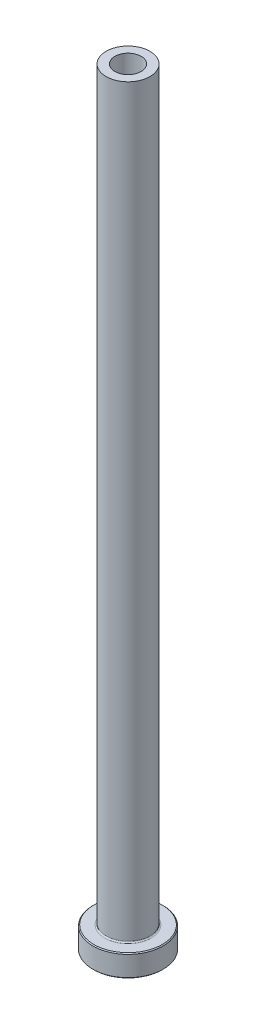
ISO-10303-21;
HEADER;
FILE_DESCRIPTION(('STEP AP214'),'2;1');
FILE_NAME('part.step','',(''),(''),'','','');
FILE_SCHEMA(('AUTOMOTIVE_DESIGN { 1 0 10303 214 1 1 1 1 }'));
ENDSEC;
DATA;
#1=APPLICATION_CONTEXT('core data for automotive mechanical design processes');
#2=APPLICATION_PROTOCOL_DEFINITION('international standard','automotive_design',2000,#1);
#3=PRODUCT_CONTEXT('',#1,'mechanical');
#4=PRODUCT('Part','Part','',(#3));
#5=PRODUCT_RELATED_PRODUCT_CATEGORY('part','',(#4));
#6=PRODUCT_DEFINITION_FORMATION('','',#4);
#7=PRODUCT_DEFINITION_CONTEXT('part definition',#1,'design');
#8=PRODUCT_DEFINITION('design','',#6,#7);
#9=PRODUCT_DEFINITION_SHAPE('','',#8);
#10=(LENGTH_UNIT() NAMED_UNIT(*) SI_UNIT(.MILLI.,.METRE.));
#11=(NAMED_UNIT(*) PLANE_ANGLE_UNIT() SI_UNIT($,.RADIAN.));
#12=(NAMED_UNIT(*) SI_UNIT($,.STERADIAN.) SOLID_ANGLE_UNIT());
#13=UNCERTAINTY_MEASURE_WITH_UNIT(LENGTH_MEASURE(1.E-05),#10,'distance_accuracy_value','');
#14=(GEOMETRIC_REPRESENTATION_CONTEXT(3) GLOBAL_UNCERTAINTY_ASSIGNED_CONTEXT((#13)) GLOBAL_UNIT_ASSIGNED_CONTEXT((#10,
#11,#12)) REPRESENTATION_CONTEXT('',''));
#15=CARTESIAN_POINT('',(0.,0.,0.));
#16=DIRECTION('',(0.,0.,1.));
#17=DIRECTION('',(1.,0.,0.));
#18=AXIS2_PLACEMENT_3D('',#15,#16,#17);
#19=CARTESIAN_POINT('',(0.,92.1876809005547,0.));
#20=DIRECTION('',(0.,1.,0.));
#21=DIRECTION('',(0.,0.,1.));
#22=AXIS2_PLACEMENT_3D('',#19,#20,#21);
#23=CYLINDRICAL_SURFACE('',#22,3.);
#24=CARTESIAN_POINT('',(0.,175.,0.));
#25=DIRECTION('',(0.,1.,0.));
#26=DIRECTION('',(0.,0.,1.));
#27=AXIS2_PLACEMENT_3D('',#24,#25,#26);
#28=CIRCLE('',#27,3.);
#29=CARTESIAN_POINT('',(0.,175.,3.));
#30=VERTEX_POINT('',#29);
#31=EDGE_CURVE('E62',#30,#30,#28,.T.);
#32=ORIENTED_EDGE('',*,*,#31,.T.);
#33=EDGE_LOOP('',(#32));
#34=FACE_BOUND('',#33,.T.);
#35=CARTESIAN_POINT('',(0.,130.,0.));
#36=DIRECTION('',(0.,1.,0.));
#37=DIRECTION('',(0.,0.,1.));
#38=AXIS2_PLACEMENT_3D('',#35,#36,#37);
#39=CIRCLE('',#38,3.);
#40=CARTESIAN_POINT('',(0.,130.,3.));
#41=VERTEX_POINT('',#40);
#42=EDGE_CURVE('E71',#41,#41,#39,.T.);
#43=ORIENTED_EDGE('',*,*,#42,.F.);
#44=EDGE_LOOP('',(#43));
#45=FACE_BOUND('',#44,.T.);
#46=ADVANCED_FACE('F30',(#34,#45),#23,.F.);
#47=CARTESIAN_POINT('',(-3.,175.,0.));
#48=DIRECTION('',(0.,1.,0.));
#49=DIRECTION('',(0.,0.,1.));
#50=AXIS2_PLACEMENT_3D('',#47,#48,#49);
#51=PLANE('',#50);
#52=CARTESIAN_POINT('',(0.,175.,0.));
#53=DIRECTION('',(0.,1.,0.));
#54=DIRECTION('',(0.,0.,1.));
#55=AXIS2_PLACEMENT_3D('',#52,#53,#54);
#56=CIRCLE('',#55,5.00000000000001);
#57=CARTESIAN_POINT('',(0.,175.,5.00000000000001));
#58=VERTEX_POINT('',#57);
#59=EDGE_CURVE('E65',#58,#58,#56,.T.);
#60=ORIENTED_EDGE('',*,*,#59,.T.);
#61=EDGE_LOOP('',(#60));
#62=FACE_BOUND('',#61,.T.);
#63=ORIENTED_EDGE('',*,*,#31,.F.);
#64=EDGE_LOOP('',(#63));
#65=FACE_BOUND('',#64,.T.);
#66=ADVANCED_FACE('F79',(#62,#65),#51,.T.);
#67=CARTESIAN_POINT('',(0.,92.1876809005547,0.));
#68=DIRECTION('',(0.,1.,0.));
#69=DIRECTION('',(0.,0.,1.));
#70=AXIS2_PLACEMENT_3D('',#67,#68,#69);
#71=CYLINDRICAL_SURFACE('',#70,5.);
#72=CARTESIAN_POINT('',(0.,5.3,0.));
#73=DIRECTION('',(0.,1.,0.));
#74=DIRECTION('',(0.,0.,1.));
#75=AXIS2_PLACEMENT_3D('',#72,#73,#74);
#76=CIRCLE('',#75,5.);
#77=CARTESIAN_POINT('',(0.,5.3,5.));
#78=VERTEX_POINT('',#77);
#79=EDGE_CURVE('E59',#78,#78,#76,.T.);
#80=ORIENTED_EDGE('',*,*,#79,.T.);
#81=EDGE_LOOP('',(#80));
#82=FACE_BOUND('',#81,.T.);
#83=ORIENTED_EDGE('',*,*,#59,.F.);
#84=EDGE_LOOP('',(#83));
#85=FACE_BOUND('',#84,.T.);
#86=ADVANCED_FACE('F85',(#82,#85),#71,.T.);
#87=CARTESIAN_POINT('',(-4.99999999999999,5.,0.));
#88=DIRECTION('',(0.,1.,0.));
#89=DIRECTION('',(0.,0.,1.));
#90=AXIS2_PLACEMENT_3D('',#87,#88,#89);
#91=PLANE('',#90);
#92=CARTESIAN_POINT('',(0.,5.,0.));
#93=DIRECTION('',(0.,1.,0.));
#94=DIRECTION('',(0.,0.,1.));
#95=AXIS2_PLACEMENT_3D('',#92,#93,#94);
#96=CIRCLE('',#95,7.80000000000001);
#97=CARTESIAN_POINT('',(0.,5.,-7.80000000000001));
#98=VERTEX_POINT('',#97);
#99=EDGE_CURVE('E53',#98,#98,#96,.T.);
#100=ORIENTED_EDGE('',*,*,#99,.T.);
#101=EDGE_LOOP('',(#100));
#102=FACE_BOUND('',#101,.T.);
#103=CARTESIAN_POINT('',(0.,5.,0.));
#104=DIRECTION('',(0.,1.,0.));
#105=DIRECTION('',(0.,0.,1.));
#106=AXIS2_PLACEMENT_3D('',#103,#104,#105);
#107=CIRCLE('',#106,5.3);
#108=CARTESIAN_POINT('',(0.,5.,5.3));
#109=VERTEX_POINT('',#108);
#110=EDGE_CURVE('E56',#109,#109,#107,.F.);
#111=ORIENTED_EDGE('',*,*,#110,.T.);
#112=EDGE_LOOP('',(#111));
#113=FACE_BOUND('',#112,.T.);
#114=ADVANCED_FACE('F111',(#102,#113),#91,.T.);
#115=CARTESIAN_POINT('',(0.,92.1876809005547,0.));
#116=DIRECTION('',(0.,1.,0.));
#117=DIRECTION('',(0.,0.,1.));
#118=AXIS2_PLACEMENT_3D('',#115,#116,#117);
#119=CYLINDRICAL_SURFACE('',#118,7.99999999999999);
#120=CARTESIAN_POINT('',(0.,4.80000000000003,0.));
#121=DIRECTION('',(0.,1.,0.));
#122=DIRECTION('',(0.,0.,1.));
#123=AXIS2_PLACEMENT_3D('',#120,#121,#122);
#124=CIRCLE('',#123,7.99999999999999);
#125=CARTESIAN_POINT('',(0.,4.80000000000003,-7.99999999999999));
#126=VERTEX_POINT('',#125);
#127=EDGE_CURVE('E45',#126,#126,#124,.F.);
#128=ORIENTED_EDGE('',*,*,#127,.T.);
#129=EDGE_LOOP('',(#128));
#130=FACE_BOUND('',#129,.T.);
#131=CARTESIAN_POINT('',(0.,0.200000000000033,0.));
#132=DIRECTION('',(0.,-1.,0.));
#133=DIRECTION('',(0.,0.,-1.));
#134=AXIS2_PLACEMENT_3D('',#131,#132,#133);
#135=CIRCLE('',#134,7.99999999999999);
#136=CARTESIAN_POINT('',(0.,0.200000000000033,-7.99999999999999));
#137=VERTEX_POINT('',#136);
#138=EDGE_CURVE('E50',#137,#137,#135,.F.);
#139=ORIENTED_EDGE('',*,*,#138,.T.);
#140=EDGE_LOOP('',(#139));
#141=FACE_BOUND('',#140,.T.);
#142=ADVANCED_FACE('F108',(#130,#141),#119,.T.);
#143=CARTESIAN_POINT('',(-7.99999999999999,0.,0.));
#144=DIRECTION('',(0.,-1.,0.));
#145=DIRECTION('',(0.,0.,-1.));
#146=AXIS2_PLACEMENT_3D('',#143,#144,#145);
#147=PLANE('',#146);
#148=CARTESIAN_POINT('',(0.,0.,0.));
#149=DIRECTION('',(0.,-1.,0.));
#150=DIRECTION('',(0.,0.,-1.));
#151=AXIS2_PLACEMENT_3D('',#148,#149,#150);
#152=CIRCLE('',#151,3.74999999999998);
#153=CARTESIAN_POINT('',(0.,0.,-3.74999999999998));
#154=VERTEX_POINT('',#153);
#155=EDGE_CURVE('E37',#154,#154,#152,.F.);
#156=ORIENTED_EDGE('',*,*,#155,.T.);
#157=EDGE_LOOP('',(#156));
#158=FACE_BOUND('',#157,.T.);
#159=CARTESIAN_POINT('',(0.,0.,0.));
#160=DIRECTION('',(0.,-1.,0.));
#161=DIRECTION('',(0.,0.,-1.));
#162=AXIS2_PLACEMENT_3D('',#159,#160,#161);
#163=CIRCLE('',#162,7.79999999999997);
#164=CARTESIAN_POINT('',(0.,0.,-7.79999999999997));
#165=VERTEX_POINT('',#164);
#166=EDGE_CURVE('E41',#165,#165,#163,.T.);
#167=ORIENTED_EDGE('',*,*,#166,.T.);
#168=EDGE_LOOP('',(#167));
#169=FACE_BOUND('',#168,.T.);
#170=ADVANCED_FACE('F110',(#158,#169),#147,.T.);
#171=CARTESIAN_POINT('',(0.,92.1876809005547,0.));
#172=DIRECTION('',(0.,1.,0.));
#173=DIRECTION('',(0.,0.,1.));
#174=AXIS2_PLACEMENT_3D('',#171,#172,#173);
#175=CYLINDRICAL_SURFACE('',#174,3.25);
#176=CARTESIAN_POINT('',(0.,0.499999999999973,0.));
#177=DIRECTION('',(0.,-1.,0.));
#178=DIRECTION('',(0.,0.,-1.));
#179=AXIS2_PLACEMENT_3D('',#176,#177,#178);
#180=CIRCLE('',#179,3.25);
#181=CARTESIAN_POINT('',(0.,0.499999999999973,-3.25));
#182=VERTEX_POINT('',#181);
#183=EDGE_CURVE('E10',#182,#182,#180,.T.);
#184=ORIENTED_EDGE('',*,*,#183,.T.);
#185=EDGE_LOOP('',(#184));
#186=FACE_BOUND('',#185,.T.);
#187=CARTESIAN_POINT('',(0.,118.,0.));
#188=DIRECTION('',(0.,1.,0.));
#189=DIRECTION('',(0.,0.,1.));
#190=AXIS2_PLACEMENT_3D('',#187,#188,#189);
#191=CIRCLE('',#190,3.25);
#192=CARTESIAN_POINT('',(0.,118.,3.25));
#193=VERTEX_POINT('',#192);
#194=EDGE_CURVE('E68',#193,#193,#191,.T.);
#195=ORIENTED_EDGE('',*,*,#194,.T.);
#196=EDGE_LOOP('',(#195));
#197=FACE_BOUND('',#196,.T.);
#198=ADVANCED_FACE('F118',(#186,#197),#175,.F.);
#199=CARTESIAN_POINT('',(0.,118.,0.));
#200=DIRECTION('',(0.,-1.,0.));
#201=DIRECTION('',(0.,0.,-1.));
#202=AXIS2_PLACEMENT_3D('',#199,#200,#201);
#203=CONICAL_SURFACE('',#202,3.25,0.0208303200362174);
#204=ORIENTED_EDGE('',*,*,#42,.T.);
#205=EDGE_LOOP('',(#204));
#206=FACE_BOUND('',#205,.T.);
#207=ORIENTED_EDGE('',*,*,#194,.F.);
#208=EDGE_LOOP('',(#207));
#209=FACE_BOUND('',#208,.T.);
#210=ADVANCED_FACE('F75',(#206,#209),#203,.F.);
#211=CARTESIAN_POINT('',(0.,5.3,0.));
#212=DIRECTION('',(0.,1.,0.));
#213=DIRECTION('',(0.,0.,1.));
#214=AXIS2_PLACEMENT_3D('',#211,#212,#213);
#215=TOROIDAL_SURFACE('',#214,5.3,0.3);
#216=ORIENTED_EDGE('',*,*,#110,.F.);
#217=EDGE_LOOP('',(#216));
#218=FACE_BOUND('',#217,.T.);
#219=ORIENTED_EDGE('',*,*,#79,.F.);
#220=EDGE_LOOP('',(#219));
#221=FACE_BOUND('',#220,.T.);
#222=ADVANCED_FACE('F90',(#218,#221),#215,.F.);
#223=CARTESIAN_POINT('',(0.,5.,0.));
#224=DIRECTION('',(0.,-1.,0.));
#225=DIRECTION('',(0.,0.,-1.));
#226=AXIS2_PLACEMENT_3D('',#223,#224,#225);
#227=CONICAL_SURFACE('',#226,7.8,0.785398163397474);
#228=CARTESIAN_POINT('',(0.,4.80000000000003,-7.99999999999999));
#229=CARTESIAN_POINT('',(0.,4.80208333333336,-7.99791666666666));
#230=CARTESIAN_POINT('',(0.,4.80416666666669,-7.99583333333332));
#231=CARTESIAN_POINT('',(0.,4.80833333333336,-7.99166666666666));
#232=CARTESIAN_POINT('',(0.,4.81041666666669,-7.98958333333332));
#233=CARTESIAN_POINT('',(0.,4.81458333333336,-7.98541666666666));
#234=CARTESIAN_POINT('',(0.,4.81666666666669,-7.98333333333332));
#235=CARTESIAN_POINT('',(0.,4.82083333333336,-7.97916666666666));
#236=CARTESIAN_POINT('',(0.,4.82291666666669,-7.97708333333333));
#237=CARTESIAN_POINT('',(0.,4.82708333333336,-7.97291666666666));
#238=CARTESIAN_POINT('',(0.,4.82916666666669,-7.97083333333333));
#239=CARTESIAN_POINT('',(0.,4.83333333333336,-7.96666666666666));
#240=CARTESIAN_POINT('',(0.,4.83541666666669,-7.96458333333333));
#241=CARTESIAN_POINT('',(0.,4.83958333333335,-7.96041666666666));
#242=CARTESIAN_POINT('',(0.,4.84166666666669,-7.95833333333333));
#243=CARTESIAN_POINT('',(0.,4.84583333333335,-7.95416666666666));
#244=CARTESIAN_POINT('',(0.,4.84791666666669,-7.95208333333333));
#245=CARTESIAN_POINT('',(0.,4.85208333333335,-7.94791666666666));
#246=CARTESIAN_POINT('',(0.,4.85416666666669,-7.94583333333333));
#247=CARTESIAN_POINT('',(0.,4.85833333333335,-7.94166666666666));
#248=CARTESIAN_POINT('',(0.,4.86041666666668,-7.93958333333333));
#249=CARTESIAN_POINT('',(0.,4.86458333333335,-7.93541666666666));
#250=CARTESIAN_POINT('',(0.,4.86666666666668,-7.93333333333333));
#251=CARTESIAN_POINT('',(0.,4.87083333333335,-7.92916666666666));
#252=CARTESIAN_POINT('',(0.,4.87291666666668,-7.92708333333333));
#253=CARTESIAN_POINT('',(0.,4.87708333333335,-7.92291666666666));
#254=CARTESIAN_POINT('',(0.,4.87916666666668,-7.92083333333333));
#255=CARTESIAN_POINT('',(0.,4.88333333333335,-7.91666666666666));
#256=CARTESIAN_POINT('',(0.,4.88541666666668,-7.91458333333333));
#257=CARTESIAN_POINT('',(0.,4.88958333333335,-7.91041666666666));
#258=CARTESIAN_POINT('',(0.,4.89166666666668,-7.90833333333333));
#259=CARTESIAN_POINT('',(0.,4.89583333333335,-7.90416666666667));
#260=CARTESIAN_POINT('',(0.,4.89791666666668,-7.90208333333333));
#261=CARTESIAN_POINT('',(0.,4.90208333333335,-7.89791666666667));
#262=CARTESIAN_POINT('',(0.,4.90416666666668,-7.89583333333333));
#263=CARTESIAN_POINT('',(0.,4.90833333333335,-7.89166666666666));
#264=CARTESIAN_POINT('',(0.,4.91041666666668,-7.88958333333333));
#265=CARTESIAN_POINT('',(0.,4.91458333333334,-7.88541666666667));
#266=CARTESIAN_POINT('',(0.,4.91666666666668,-7.88333333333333));
#267=CARTESIAN_POINT('',(0.,4.92083333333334,-7.87916666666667));
#268=CARTESIAN_POINT('',(0.,4.92291666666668,-7.87708333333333));
#269=CARTESIAN_POINT('',(0.,4.92708333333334,-7.87291666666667));
#270=CARTESIAN_POINT('',(0.,4.92916666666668,-7.87083333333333));
#271=CARTESIAN_POINT('',(0.,4.93333333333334,-7.86666666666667));
#272=CARTESIAN_POINT('',(0.,4.93541666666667,-7.86458333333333));
#273=CARTESIAN_POINT('',(0.,4.93958333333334,-7.86041666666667));
#274=CARTESIAN_POINT('',(0.,4.94166666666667,-7.85833333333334));
#275=CARTESIAN_POINT('',(0.,4.94583333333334,-7.85416666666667));
#276=CARTESIAN_POINT('',(0.,4.94791666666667,-7.85208333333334));
#277=CARTESIAN_POINT('',(0.,4.95208333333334,-7.84791666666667));
#278=CARTESIAN_POINT('',(0.,4.95416666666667,-7.84583333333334));
#279=CARTESIAN_POINT('',(0.,4.95833333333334,-7.84166666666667));
#280=CARTESIAN_POINT('',(0.,4.96041666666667,-7.83958333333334));
#281=CARTESIAN_POINT('',(0.,4.96458333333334,-7.83541666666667));
#282=CARTESIAN_POINT('',(0.,4.96666666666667,-7.83333333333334));
#283=CARTESIAN_POINT('',(0.,4.97083333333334,-7.82916666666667));
#284=CARTESIAN_POINT('',(0.,4.97291666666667,-7.82708333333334));
#285=CARTESIAN_POINT('',(0.,4.97708333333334,-7.82291666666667));
#286=CARTESIAN_POINT('',(0.,4.97916666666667,-7.82083333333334));
#287=CARTESIAN_POINT('',(0.,4.98333333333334,-7.81666666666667));
#288=CARTESIAN_POINT('',(0.,4.98541666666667,-7.81458333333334));
#289=CARTESIAN_POINT('',(0.,4.98958333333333,-7.81041666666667));
#290=CARTESIAN_POINT('',(0.,4.99166666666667,-7.80833333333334));
#291=CARTESIAN_POINT('',(0.,4.99583333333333,-7.80416666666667));
#292=CARTESIAN_POINT('',(0.,4.99791666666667,-7.80208333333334));
#293=CARTESIAN_POINT('',(0.,5.,-7.80000000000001));
#294=B_SPLINE_CURVE_WITH_KNOTS('',3,(#228,#229,#230,#231,#232,#233,#234,#235,#236,#237,#238,
#239,#240,#241,#242,#243,#244,#245,#246,#247,#248,#249,#250,#251,#252,#253,#254,#255,#256,#257,
#258,#259,#260,#261,#262,#263,#264,#265,#266,#267,#268,#269,#270,#271,#272,#273,#274,#275,#276,
#277,#278,#279,#280,#281,#282,#283,#284,#285,#286,#287,#288,#289,#290,#291,#292,#293),
.UNSPECIFIED.,.F.,.F.,(4,2,2,2,2,2,2,2,2,2,2,2,2,2,2,2,2,2,2,2,2,2,2,2,2,2,2,2,2,2,2,2,4),(0.,
0.00883883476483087,0.0176776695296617,0.0265165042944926,0.0353553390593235,0.0441941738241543,
0.0530330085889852,0.0618718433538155,0.0707106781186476,0.0795495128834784,0.0883883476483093,
0.0972271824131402,0.106066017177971,0.114904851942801,0.123743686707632,0.132582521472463,
0.141421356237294,0.150260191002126,0.159099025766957,0.167937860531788,0.176776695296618,
0.185615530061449,0.19445436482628,0.203293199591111,0.212132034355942,0.220970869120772,
0.229809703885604,0.238648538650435,0.247487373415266,0.256326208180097,0.265165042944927,
0.274003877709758,0.282842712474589),.UNSPECIFIED.);
#295=EDGE_CURVE('BSEAM93',#126,#98,#294,.T.);
#296=ORIENTED_EDGE('',*,*,#127,.F.);
#297=ORIENTED_EDGE('',*,*,#99,.F.);
#298=ORIENTED_EDGE('',*,*,#295,.T.);
#299=ORIENTED_EDGE('',*,*,#295,.F.);
#300=EDGE_LOOP('',(#296,#298,#297,#299));
#301=FACE_BOUND('',#300,.T.);
#302=ADVANCED_FACE('F93',(#301),#227,.T.);
#303=CARTESIAN_POINT('',(0.,0.200000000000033,0.));
#304=DIRECTION('',(0.,1.,0.));
#305=DIRECTION('',(0.,0.,1.));
#306=AXIS2_PLACEMENT_3D('',#303,#304,#305);
#307=CONICAL_SURFACE('',#306,7.99999999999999,0.785398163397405);
#308=ORIENTED_EDGE('',*,*,#166,.F.);
#309=EDGE_LOOP('',(#308));
#310=FACE_BOUND('',#309,.T.);
#311=ORIENTED_EDGE('',*,*,#138,.F.);
#312=EDGE_LOOP('',(#311));
#313=FACE_BOUND('',#312,.T.);
#314=ADVANCED_FACE('F96',(#310,#313),#307,.T.);
#315=CARTESIAN_POINT('',(0.,0.,0.));
#316=DIRECTION('',(0.,-1.,0.));
#317=DIRECTION('',(0.,0.,-1.));
#318=AXIS2_PLACEMENT_3D('',#315,#316,#317);
#319=CONICAL_SURFACE('',#318,3.74999999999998,0.785398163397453);
#320=ORIENTED_EDGE('',*,*,#183,.F.);
#321=EDGE_LOOP('',(#320));
#322=FACE_BOUND('',#321,.T.);
#323=ORIENTED_EDGE('',*,*,#155,.F.);
#324=EDGE_LOOP('',(#323));
#325=FACE_BOUND('',#324,.T.);
#326=ADVANCED_FACE('F32',(#322,#325),#319,.F.);
#327=CLOSED_SHELL('',(#46,#66,#86,#114,#142,#170,#198,#210,#222,#302,#314,#326));
#328=MANIFOLD_SOLID_BREP('B2',#327);
#329=ADVANCED_BREP_SHAPE_REPRESENTATION('',(#18,#328),#14);
#330=SHAPE_DEFINITION_REPRESENTATION(#9,#329);
ENDSEC;
END-ISO-10303-21;
